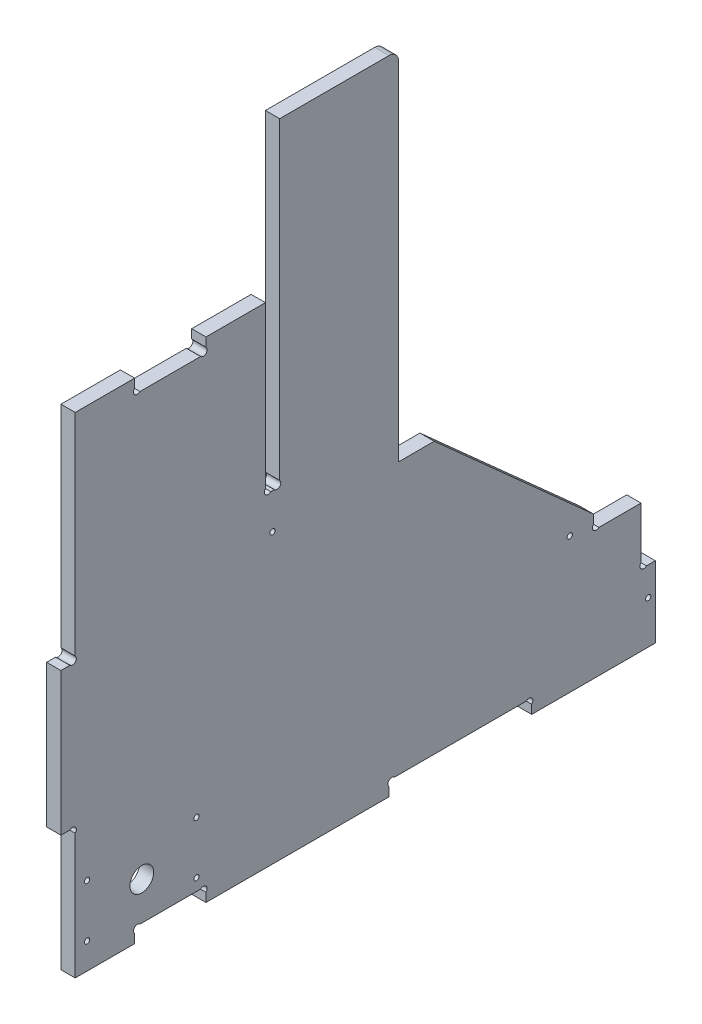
from build123d import *

# Parameters (mm, degrees)
ESQUISSE1_R        = 1.1
ESQUISSE1_R_2      = 5
BOSS_EXTRU_1_DEPTH = 6


with BuildPart() as part:
    # Esquisse1 → Boss.-Extru.1 (new body)
    with BuildSketch(Plane(origin=(0, 0, 0), x_dir=(0, 0, -1), z_dir=(1, 0, 0))):
        with BuildLine():
            Line((3.7372583, 115), (0, 115))
            Line((0, 115), (0, 55))
            Line((0, 55), (3.7372583, 55))
            ThreePointArc((3.7372583, 55), (6, 55), (6, 52.7372583))
            Line((6, 52.7372583), (6, 0))
            Line((6, 0), (31, 0))
            Line((31, 0), (31, 3.7372583))
            ThreePointArc((31, 3.7372583), (31, 6), (33.2627417, 6))
            Line((33.2627417, 6), (58.7372583, 6))
            ThreePointArc((58.7372583, 6), (61, 6), (61, 3.7372583))
            Line((61, 3.7372583), (61, 0))
            Line((61, 0), (138, 0))
            Line((138, 0), (138, 3.7372583))
            ThreePointArc((138, 3.7372583), (138, 6), (140.2627417, 6))
            Line((140.2627417, 6), (195.7372583, 6))
            ThreePointArc((195.7372583, 6), (198, 6), (198, 3.7372583))
            Line((198, 3.7372583), (198, 0))
            Line((198, 0), (250, 0))
            Line((250, 0), (250, 30))
            Line((250, 30), (246.2627417, 30))
            ThreePointArc((246.2627417, 30), (244, 30), (244, 32.2627417))
            Line((244, 32.2627417), (244, 54))
            Line((244, 54), (226.2627417, 54))
            ThreePointArc((226.2627417, 54), (224, 54), (224, 56.2627417))
            Line((224, 56.2627417), (224, 60))
            Line((224, 60), (157, 120))
            Line((157, 120), (142, 120))
            Line((142, 120), (142, 266))
            ThreePointArc((142, 266), (140.828427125, 268.828427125), (138, 270))
            Line((138, 270), (92, 270))
            Line((92, 270), (92, 138.2627417))
            ThreePointArc((92, 138.2627417), (92, 136), (89.7372583, 136))
            Line((89.7372583, 136), (88.2627417, 136))
            ThreePointArc((88.2627417, 136), (86, 136), (86, 138.2627417))
            Line((86, 138.2627417), (86, 206))
            Line((86, 206), (61, 206))
            Line((61, 206), (61, 202.2627417))
            ThreePointArc((61, 202.2627417), (61, 200), (58.7372583, 200))
            Line((58.7372583, 200), (33.2627417, 200))
            ThreePointArc((33.2627417, 200), (31, 200), (31, 202.2627417))
            Line((31, 202.2627417), (31, 206))
            Line((31, 206), (6, 206))
            Line((6, 206), (6, 117.2627417))
            ThreePointArc((6, 117.2627417), (6, 115), (3.7372583, 115))
        make_face()
        with Locations((11, 11)):
            Circle(ESQUISSE1_R, mode=Mode.SUBTRACT)
        with Locations((57, 33)):
            Circle(ESQUISSE1_R, mode=Mode.SUBTRACT)
        with Locations(Location((57, 11, 0), (0, 0, 180))):
            Circle(ESQUISSE1_R, mode=Mode.SUBTRACT)
        with Locations(Location((11, 33, 0), (0, 0, 180))):
            Circle(ESQUISSE1_R, mode=Mode.SUBTRACT)
        with Locations((34, 22)):
            Circle(ESQUISSE1_R_2, mode=Mode.SUBTRACT)
        with Locations((247, 18)):
            Circle(ESQUISSE1_R, mode=Mode.SUBTRACT)
        with Locations((89, 121)):
            Circle(ESQUISSE1_R, mode=Mode.SUBTRACT)
        with Locations((214, 57)):
            Circle(ESQUISSE1_R, mode=Mode.SUBTRACT)
    extrude(amount=BOSS_EXTRU_1_DEPTH)


solid = part.part
